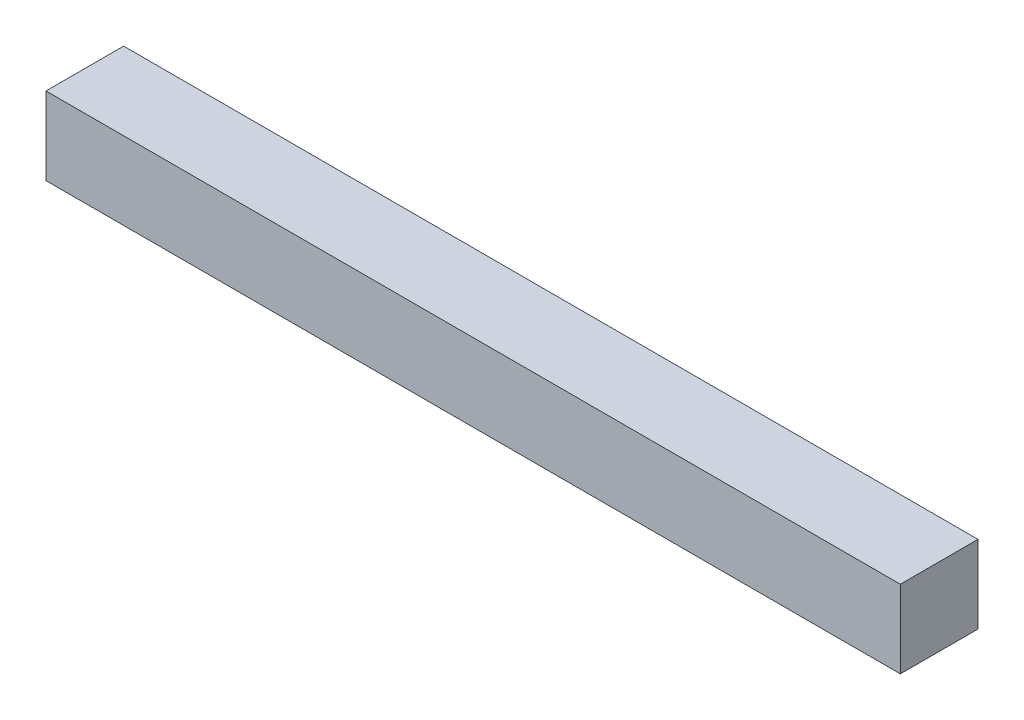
from build123d import *

# Parameters (mm, degrees)
BOSS_EXTRUDE1_DEPTH      = 11
BOSS_EXTRUDE1_DEPTH_BACK = 11
SKETCH1_W                = 2
SKETCH1_H                = 2


with BuildPart() as part:
    # Sketch1 → Boss-Extrude1 (new, two sides: drawn at the far end of the back side and taken through both)
    with BuildSketch(Plane(origin=(0, 0, 0), x_dir=(0, 0, -1), z_dir=(1, 0, 0)).offset(-BOSS_EXTRUDE1_DEPTH_BACK)):
        Rectangle(SKETCH1_W, SKETCH1_H)
    extrude(amount=BOSS_EXTRUDE1_DEPTH + BOSS_EXTRUDE1_DEPTH_BACK)


solid = part.part
